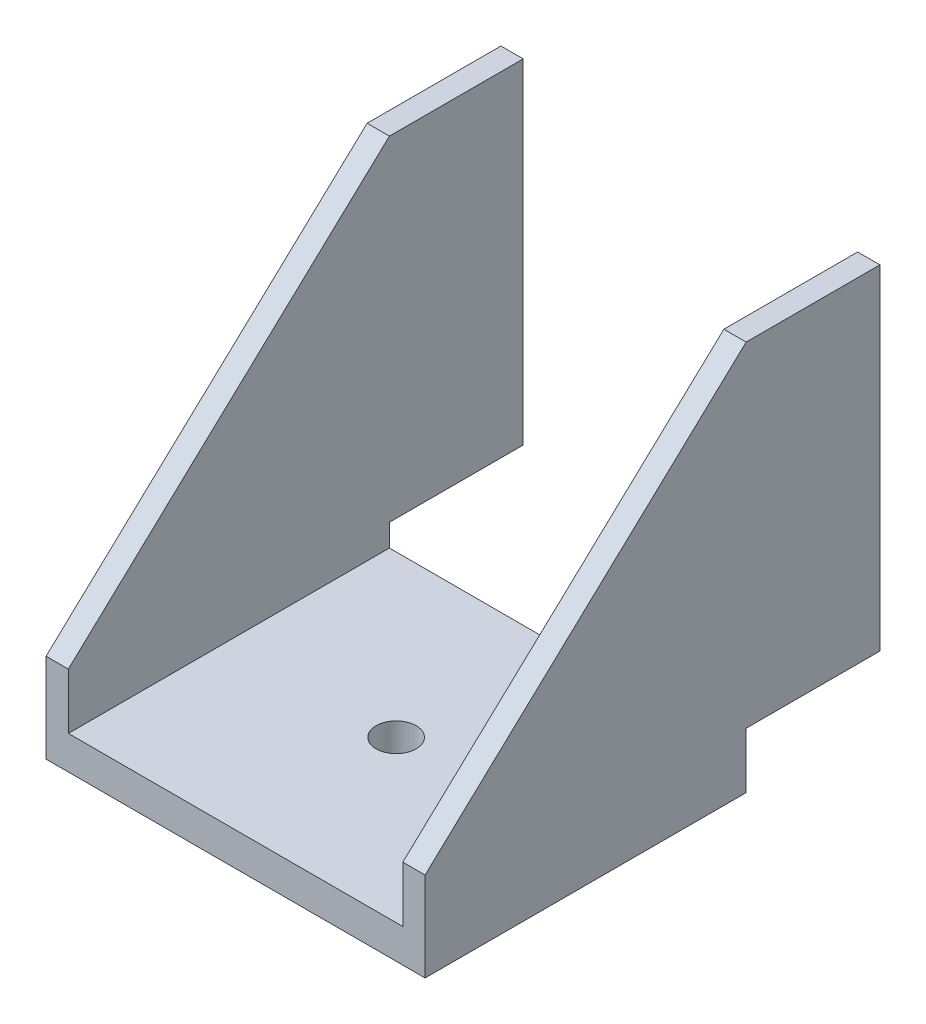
from build123d import *

# Parameters (mm, degrees)
BOSS_EXTRUDE1_DEPTH = 10
LPATTERN1_COUNT     = 2
LPATTERN1_PITCH     = 160
SKETCH2_W           = 170
SKETCH2_H           = 144
SKETCH2_R           = 9
BOSS_EXTRUDE2_DEPTH = 15


with BuildPart() as part:
    # Sketch1 → Boss-Extrude1 (new body)
    with BuildSketch(Plane(origin=(0, 0, 0), x_dir=(0, 0, -1), z_dir=(1, 0, 0))):
        Polygon((60, 150), (60, 0), (0, 0), (0, -25), (-144, -25), (-144, 15), (0, 150), align=None)
    extrude(amount=BOSS_EXTRUDE1_DEPTH)


with BuildPart() as lpattern1_1:
    # LPattern1: pattern copy
    add(part.part.moved(Location(Vector(-1, 0, 0) * (1 * LPATTERN1_PITCH))))


with BuildPart() as part_1:
    add(part.part)

    add(lpattern1_1.part)  # Boss-Extrude2 merges LPattern1_1
    # Sketch2 → Boss-Extrude2 (add)
    with BuildSketch(Plane.XZ.offset(25)):
        with Locations((-75, 72)):
            Rectangle(SKETCH2_W, SKETCH2_H)
        with Locations(Location((-75, 72, 0), (0, 0, 270))):
            Circle(SKETCH2_R, mode=Mode.SUBTRACT)
    extrude(amount=-BOSS_EXTRUDE2_DEPTH)


solid = part_1.part
